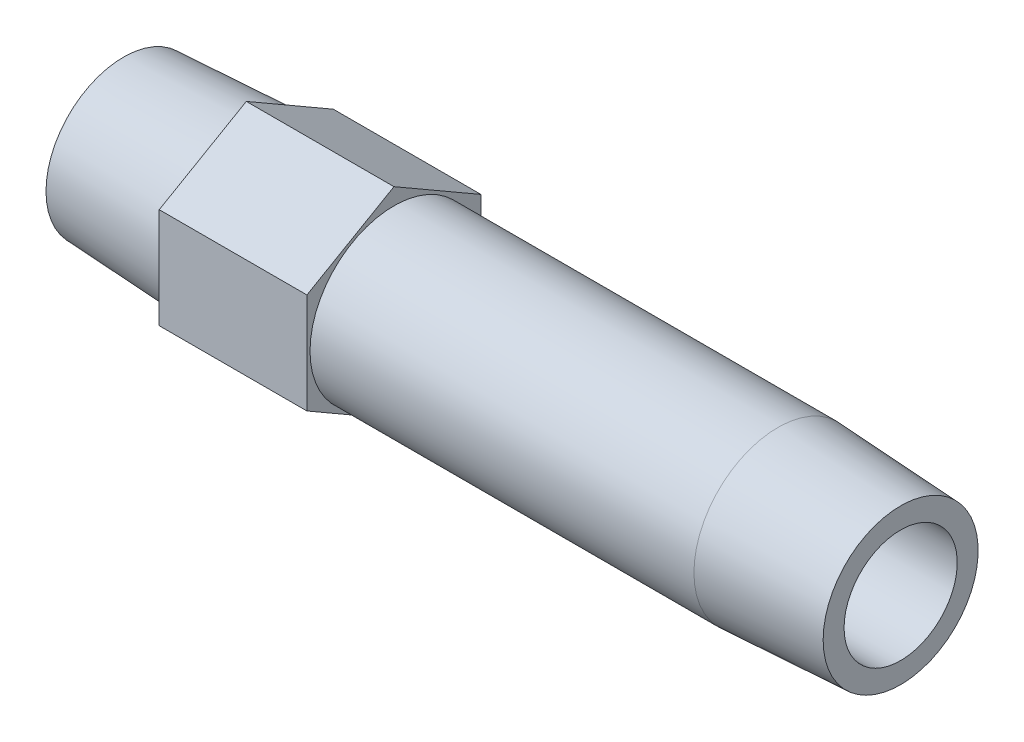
ISO-10303-21;
HEADER;
FILE_DESCRIPTION(('STEP AP214'),'2;1');
FILE_NAME('part.step','',(''),(''),'','','');
FILE_SCHEMA(('AUTOMOTIVE_DESIGN { 1 0 10303 214 1 1 1 1 }'));
ENDSEC;
DATA;
#1=APPLICATION_CONTEXT('core data for automotive mechanical design processes');
#2=APPLICATION_PROTOCOL_DEFINITION('international standard','automotive_design',2000,#1);
#3=PRODUCT_CONTEXT('',#1,'mechanical');
#4=PRODUCT('Part','Part','',(#3));
#5=PRODUCT_RELATED_PRODUCT_CATEGORY('part','',(#4));
#6=PRODUCT_DEFINITION_FORMATION('','',#4);
#7=PRODUCT_DEFINITION_CONTEXT('part definition',#1,'design');
#8=PRODUCT_DEFINITION('design','',#6,#7);
#9=PRODUCT_DEFINITION_SHAPE('','',#8);
#10=(LENGTH_UNIT() NAMED_UNIT(*) SI_UNIT(.MILLI.,.METRE.));
#11=(NAMED_UNIT(*) PLANE_ANGLE_UNIT() SI_UNIT($,.RADIAN.));
#12=(NAMED_UNIT(*) SI_UNIT($,.STERADIAN.) SOLID_ANGLE_UNIT());
#13=UNCERTAINTY_MEASURE_WITH_UNIT(LENGTH_MEASURE(1.E-05),#10,'distance_accuracy_value','');
#14=(GEOMETRIC_REPRESENTATION_CONTEXT(3) GLOBAL_UNCERTAINTY_ASSIGNED_CONTEXT((#13)) GLOBAL_UNIT_ASSIGNED_CONTEXT((#10,
#11,#12)) REPRESENTATION_CONTEXT('',''));
#15=CARTESIAN_POINT('',(0.,0.,0.));
#16=DIRECTION('',(0.,0.,1.));
#17=DIRECTION('',(1.,0.,0.));
#18=AXIS2_PLACEMENT_3D('',#15,#16,#17);
#19=CARTESIAN_POINT('',(0.,0.,-6.3321927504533));
#20=DIRECTION('',(1.,0.,0.));
#21=DIRECTION('',(0.,0.,-1.));
#22=AXIS2_PLACEMENT_3D('',#19,#20,#21);
#23=PLANE('',#22);
#24=CARTESIAN_POINT('',(0.,0.,0.));
#25=DIRECTION('',(-1.,0.,0.));
#26=DIRECTION('',(0.,0.,1.));
#27=AXIS2_PLACEMENT_3D('',#24,#25,#26);
#28=CIRCLE('',#27,6.3321927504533);
#29=CARTESIAN_POINT('',(0.,0.,6.3321927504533));
#30=VERTEX_POINT('',#29);
#31=EDGE_CURVE('E147',#30,#30,#28,.T.);
#32=ORIENTED_EDGE('',*,*,#31,.T.);
#33=EDGE_LOOP('',(#32));
#34=FACE_BOUND('',#33,.T.);
#35=CARTESIAN_POINT('',(0.,0.,0.));
#36=DIRECTION('',(1.,0.,0.));
#37=DIRECTION('',(0.,0.,1.));
#38=AXIS2_PLACEMENT_3D('',#35,#36,#37);
#39=CIRCLE('',#38,4.6228);
#40=CARTESIAN_POINT('',(0.,0.,4.6228));
#41=VERTEX_POINT('',#40);
#42=EDGE_CURVE('E159',#41,#41,#39,.T.);
#43=ORIENTED_EDGE('',*,*,#42,.T.);
#44=EDGE_LOOP('',(#43));
#45=FACE_BOUND('',#44,.T.);
#46=ADVANCED_FACE('F15',(#34,#45),#23,.F.);
#47=CARTESIAN_POINT('',(63.5,0.,-6.33219275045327));
#48=DIRECTION('',(-1.,0.,0.));
#49=DIRECTION('',(0.,0.,1.));
#50=AXIS2_PLACEMENT_3D('',#47,#48,#49);
#51=PLANE('',#50);
#52=CARTESIAN_POINT('',(63.5,0.,0.));
#53=DIRECTION('',(-1.,0.,0.));
#54=DIRECTION('',(0.,0.,1.));
#55=AXIS2_PLACEMENT_3D('',#52,#53,#54);
#56=CIRCLE('',#55,6.33219275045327);
#57=CARTESIAN_POINT('',(63.5,0.,6.33219275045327));
#58=VERTEX_POINT('',#57);
#59=EDGE_CURVE('E150',#58,#58,#56,.T.);
#60=ORIENTED_EDGE('',*,*,#59,.F.);
#61=EDGE_LOOP('',(#60));
#62=FACE_BOUND('',#61,.T.);
#63=CARTESIAN_POINT('',(63.5,0.,0.));
#64=DIRECTION('',(-1.,0.,0.));
#65=DIRECTION('',(0.,0.,1.));
#66=AXIS2_PLACEMENT_3D('',#63,#64,#65);
#67=CIRCLE('',#66,4.6228);
#68=CARTESIAN_POINT('',(63.5,0.,4.6228));
#69=VERTEX_POINT('',#68);
#70=EDGE_CURVE('E156',#69,#69,#67,.F.);
#71=ORIENTED_EDGE('',*,*,#70,.F.);
#72=EDGE_LOOP('',(#71));
#73=FACE_BOUND('',#72,.T.);
#74=ADVANCED_FACE('F178',(#62,#73),#51,.F.);
#75=CARTESIAN_POINT('',(22.098,-12.3183453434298,7.112));
#76=DIRECTION('',(-1.,0.,0.));
#77=DIRECTION('',(0.,-1.,0.));
#78=AXIS2_PLACEMENT_3D('',#75,#76,#77);
#79=PLANE('',#78);
#80=DIRECTION('',(0.,0.5,-0.866025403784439));
#81=VECTOR('',#80,1.);
#82=CARTESIAN_POINT('',(22.098,-8.21223022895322,0.));
#83=LINE('',#82,#81);
#84=CARTESIAN_POINT('',(22.098,-8.21223022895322,0.));
#85=VERTEX_POINT('',#84);
#86=CARTESIAN_POINT('',(22.098,-4.10611511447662,-7.112));
#87=VERTEX_POINT('',#86);
#88=EDGE_CURVE('E103',#85,#87,#83,.T.);
#89=ORIENTED_EDGE('',*,*,#88,.T.);
#90=DIRECTION('',(0.,1.,0.));
#91=VECTOR('',#90,1.);
#92=CARTESIAN_POINT('',(22.098,-4.10611511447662,-7.112));
#93=LINE('',#92,#91);
#94=CARTESIAN_POINT('',(22.098,4.10611511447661,-7.112));
#95=VERTEX_POINT('',#94);
#96=EDGE_CURVE('E83',#87,#95,#93,.T.);
#97=ORIENTED_EDGE('',*,*,#96,.T.);
#98=DIRECTION('',(0.,0.5,0.866025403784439));
#99=VECTOR('',#98,1.);
#100=CARTESIAN_POINT('',(22.098,4.10611511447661,-7.112));
#101=LINE('',#100,#99);
#102=CARTESIAN_POINT('',(22.098,8.21223022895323,0.));
#103=VERTEX_POINT('',#102);
#104=EDGE_CURVE('E102',#95,#103,#101,.T.);
#105=ORIENTED_EDGE('',*,*,#104,.T.);
#106=DIRECTION('',(0.,-0.5,0.866025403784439));
#107=VECTOR('',#106,1.);
#108=CARTESIAN_POINT('',(22.098,8.21223022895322,0.));
#109=LINE('',#108,#107);
#110=CARTESIAN_POINT('',(22.098,4.10611511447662,7.112));
#111=VERTEX_POINT('',#110);
#112=EDGE_CURVE('E105',#103,#111,#109,.T.);
#113=ORIENTED_EDGE('',*,*,#112,.T.);
#114=DIRECTION('',(0.,-1.,0.));
#115=VECTOR('',#114,1.);
#116=CARTESIAN_POINT('',(22.098,4.10611511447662,7.112));
#117=LINE('',#116,#115);
#118=CARTESIAN_POINT('',(22.098,-4.10611511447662,7.112));
#119=VERTEX_POINT('',#118);
#120=EDGE_CURVE('E35',#111,#119,#117,.T.);
#121=ORIENTED_EDGE('',*,*,#120,.T.);
#122=DIRECTION('',(0.,-0.5,-0.866025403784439));
#123=VECTOR('',#122,1.);
#124=CARTESIAN_POINT('',(22.098,-4.10611511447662,7.112));
#125=LINE('',#124,#123);
#126=EDGE_CURVE('E30',#119,#85,#125,.T.);
#127=ORIENTED_EDGE('',*,*,#126,.T.);
#128=EDGE_LOOP('',(#89,#97,#105,#113,#121,#127));
#129=FACE_BOUND('',#128,.T.);
#130=CARTESIAN_POINT('',(22.098,0.,0.));
#131=DIRECTION('',(-1.,0.,0.));
#132=DIRECTION('',(0.,-1.,0.));
#133=AXIS2_PLACEMENT_3D('',#130,#131,#132);
#134=CIRCLE('',#133,6.858);
#135=CARTESIAN_POINT('',(22.098,-6.858,0.));
#136=VERTEX_POINT('',#135);
#137=EDGE_CURVE('E89',#136,#136,#134,.F.);
#138=ORIENTED_EDGE('',*,*,#137,.F.);
#139=EDGE_LOOP('',(#138));
#140=FACE_BOUND('',#139,.T.);
#141=ADVANCED_FACE('F124',(#129,#140),#79,.F.);
#142=CARTESIAN_POINT('',(10.033,-12.3183453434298,7.112));
#143=DIRECTION('',(-1.,0.,0.));
#144=DIRECTION('',(0.,-1.,0.));
#145=AXIS2_PLACEMENT_3D('',#142,#143,#144);
#146=PLANE('',#145);
#147=DIRECTION('',(0.,0.5,-0.866025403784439));
#148=VECTOR('',#147,1.);
#149=CARTESIAN_POINT('',(10.033,-8.21223022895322,0.));
#150=LINE('',#149,#148);
#151=CARTESIAN_POINT('',(10.033,-8.21223022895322,0.));
#152=VERTEX_POINT('',#151);
#153=CARTESIAN_POINT('',(10.033,-4.10611511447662,-7.112));
#154=VERTEX_POINT('',#153);
#155=EDGE_CURVE('E73',#152,#154,#150,.T.);
#156=ORIENTED_EDGE('',*,*,#155,.F.);
#157=DIRECTION('',(0.,-0.5,-0.866025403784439));
#158=VECTOR('',#157,1.);
#159=CARTESIAN_POINT('',(10.033,-4.10611511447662,7.112));
#160=LINE('',#159,#158);
#161=CARTESIAN_POINT('',(10.033,-4.10611511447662,7.112));
#162=VERTEX_POINT('',#161);
#163=EDGE_CURVE('E99',#162,#152,#160,.T.);
#164=ORIENTED_EDGE('',*,*,#163,.F.);
#165=DIRECTION('',(0.,-1.,0.));
#166=VECTOR('',#165,1.);
#167=CARTESIAN_POINT('',(10.033,4.10611511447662,7.112));
#168=LINE('',#167,#166);
#169=CARTESIAN_POINT('',(10.033,4.10611511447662,7.112));
#170=VERTEX_POINT('',#169);
#171=EDGE_CURVE('E133',#170,#162,#168,.T.);
#172=ORIENTED_EDGE('',*,*,#171,.F.);
#173=DIRECTION('',(0.,-0.5,0.866025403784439));
#174=VECTOR('',#173,1.);
#175=CARTESIAN_POINT('',(10.033,8.21223022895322,0.));
#176=LINE('',#175,#174);
#177=CARTESIAN_POINT('',(10.033,8.21223022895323,0.));
#178=VERTEX_POINT('',#177);
#179=EDGE_CURVE('E129',#178,#170,#176,.T.);
#180=ORIENTED_EDGE('',*,*,#179,.F.);
#181=DIRECTION('',(0.,0.5,0.866025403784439));
#182=VECTOR('',#181,1.);
#183=CARTESIAN_POINT('',(10.033,4.10611511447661,-7.112));
#184=LINE('',#183,#182);
#185=CARTESIAN_POINT('',(10.033,4.10611511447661,-7.112));
#186=VERTEX_POINT('',#185);
#187=EDGE_CURVE('E75',#186,#178,#184,.T.);
#188=ORIENTED_EDGE('',*,*,#187,.F.);
#189=DIRECTION('',(0.,1.,0.));
#190=VECTOR('',#189,1.);
#191=CARTESIAN_POINT('',(10.033,-4.10611511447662,-7.112));
#192=LINE('',#191,#190);
#193=EDGE_CURVE('E68',#154,#186,#192,.T.);
#194=ORIENTED_EDGE('',*,*,#193,.F.);
#195=EDGE_LOOP('',(#156,#164,#172,#180,#188,#194));
#196=FACE_BOUND('',#195,.T.);
#197=CARTESIAN_POINT('',(10.033,0.,0.));
#198=DIRECTION('',(-1.,0.,0.));
#199=DIRECTION('',(0.,0.,1.));
#200=AXIS2_PLACEMENT_3D('',#197,#198,#199);
#201=CIRCLE('',#200,6.858);
#202=CARTESIAN_POINT('',(10.033,0.,6.858));
#203=VERTEX_POINT('',#202);
#204=EDGE_CURVE('E95',#203,#203,#201,.T.);
#205=ORIENTED_EDGE('',*,*,#204,.F.);
#206=EDGE_LOOP('',(#205));
#207=FACE_BOUND('',#206,.T.);
#208=ADVANCED_FACE('F69',(#196,#207),#146,.T.);
#209=CARTESIAN_POINT('',(22.098,-8.21223022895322,0.));
#210=DIRECTION('',(0.,0.866025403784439,0.5));
#211=DIRECTION('',(0.,-0.5,0.866025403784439));
#212=AXIS2_PLACEMENT_3D('',#209,#210,#211);
#213=PLANE('',#212);
#214=ORIENTED_EDGE('',*,*,#155,.T.);
#215=DIRECTION('',(-1.,0.,0.));
#216=VECTOR('',#215,1.);
#217=CARTESIAN_POINT('',(22.098,-4.10611511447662,-7.112));
#218=LINE('',#217,#216);
#219=EDGE_CURVE('E10',#87,#154,#218,.T.);
#220=ORIENTED_EDGE('',*,*,#219,.F.);
#221=ORIENTED_EDGE('',*,*,#88,.F.);
#222=DIRECTION('',(-1.,0.,0.));
#223=VECTOR('',#222,1.);
#224=CARTESIAN_POINT('',(22.098,-8.21223022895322,0.));
#225=LINE('',#224,#223);
#226=EDGE_CURVE('E87',#85,#152,#225,.T.);
#227=ORIENTED_EDGE('',*,*,#226,.T.);
#228=EDGE_LOOP('',(#214,#220,#221,#227));
#229=FACE_BOUND('',#228,.T.);
#230=ADVANCED_FACE('F17',(#229),#213,.F.);
#231=CARTESIAN_POINT('',(22.098,-4.10611511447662,-7.112));
#232=DIRECTION('',(0.,0.,1.));
#233=DIRECTION('',(0.,-1.,0.));
#234=AXIS2_PLACEMENT_3D('',#231,#232,#233);
#235=PLANE('',#234);
#236=ORIENTED_EDGE('',*,*,#193,.T.);
#237=DIRECTION('',(-1.,0.,0.));
#238=VECTOR('',#237,1.);
#239=CARTESIAN_POINT('',(22.098,4.10611511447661,-7.112));
#240=LINE('',#239,#238);
#241=EDGE_CURVE('E23',#95,#186,#240,.T.);
#242=ORIENTED_EDGE('',*,*,#241,.F.);
#243=ORIENTED_EDGE('',*,*,#96,.F.);
#244=ORIENTED_EDGE('',*,*,#219,.T.);
#245=EDGE_LOOP('',(#236,#242,#243,#244));
#246=FACE_BOUND('',#245,.T.);
#247=ADVANCED_FACE('F82',(#246),#235,.F.);
#248=CARTESIAN_POINT('',(22.098,4.10611511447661,-7.112));
#249=DIRECTION('',(0.,-0.866025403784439,0.5));
#250=DIRECTION('',(0.,-0.5,-0.866025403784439));
#251=AXIS2_PLACEMENT_3D('',#248,#249,#250);
#252=PLANE('',#251);
#253=ORIENTED_EDGE('',*,*,#187,.T.);
#254=DIRECTION('',(-1.,0.,0.));
#255=VECTOR('',#254,1.);
#256=CARTESIAN_POINT('',(22.098,8.21223022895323,0.));
#257=LINE('',#256,#255);
#258=EDGE_CURVE('E117',#103,#178,#257,.T.);
#259=ORIENTED_EDGE('',*,*,#258,.F.);
#260=ORIENTED_EDGE('',*,*,#104,.F.);
#261=ORIENTED_EDGE('',*,*,#241,.T.);
#262=EDGE_LOOP('',(#253,#259,#260,#261));
#263=FACE_BOUND('',#262,.T.);
#264=ADVANCED_FACE('F121',(#263),#252,.F.);
#265=CARTESIAN_POINT('',(22.098,8.21223022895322,0.));
#266=DIRECTION('',(0.,-0.866025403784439,-0.5));
#267=DIRECTION('',(0.,0.5,-0.866025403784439));
#268=AXIS2_PLACEMENT_3D('',#265,#266,#267);
#269=PLANE('',#268);
#270=ORIENTED_EDGE('',*,*,#179,.T.);
#271=DIRECTION('',(-1.,0.,0.));
#272=VECTOR('',#271,1.);
#273=CARTESIAN_POINT('',(22.098,4.10611511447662,7.112));
#274=LINE('',#273,#272);
#275=EDGE_CURVE('E114',#111,#170,#274,.T.);
#276=ORIENTED_EDGE('',*,*,#275,.F.);
#277=ORIENTED_EDGE('',*,*,#112,.F.);
#278=ORIENTED_EDGE('',*,*,#258,.T.);
#279=EDGE_LOOP('',(#270,#276,#277,#278));
#280=FACE_BOUND('',#279,.T.);
#281=ADVANCED_FACE('F128',(#280),#269,.F.);
#282=CARTESIAN_POINT('',(22.098,4.10611511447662,7.112));
#283=DIRECTION('',(0.,0.,-1.));
#284=DIRECTION('',(-1.,0.,0.));
#285=AXIS2_PLACEMENT_3D('',#282,#283,#284);
#286=PLANE('',#285);
#287=ORIENTED_EDGE('',*,*,#171,.T.);
#288=DIRECTION('',(-1.,0.,0.));
#289=VECTOR('',#288,1.);
#290=CARTESIAN_POINT('',(22.098,-4.10611511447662,7.112));
#291=LINE('',#290,#289);
#292=EDGE_CURVE('E111',#119,#162,#291,.T.);
#293=ORIENTED_EDGE('',*,*,#292,.F.);
#294=ORIENTED_EDGE('',*,*,#120,.F.);
#295=ORIENTED_EDGE('',*,*,#275,.T.);
#296=EDGE_LOOP('',(#287,#293,#294,#295));
#297=FACE_BOUND('',#296,.T.);
#298=ADVANCED_FACE('F132',(#297),#286,.F.);
#299=CARTESIAN_POINT('',(22.098,-4.10611511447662,7.112));
#300=DIRECTION('',(0.,0.866025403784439,-0.5));
#301=DIRECTION('',(0.,0.5,0.866025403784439));
#302=AXIS2_PLACEMENT_3D('',#299,#300,#301);
#303=PLANE('',#302);
#304=ORIENTED_EDGE('',*,*,#163,.T.);
#305=ORIENTED_EDGE('',*,*,#226,.F.);
#306=ORIENTED_EDGE('',*,*,#126,.F.);
#307=ORIENTED_EDGE('',*,*,#292,.T.);
#308=EDGE_LOOP('',(#304,#305,#306,#307));
#309=FACE_BOUND('',#308,.T.);
#310=ADVANCED_FACE('F135',(#309),#303,.F.);
#311=CARTESIAN_POINT('',(10.033,0.,0.));
#312=DIRECTION('',(1.,0.,0.));
#313=DIRECTION('',(0.,0.,-1.));
#314=AXIS2_PLACEMENT_3D('',#311,#312,#313);
#315=CONICAL_SURFACE('',#314,6.858,0.0523598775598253);
#316=ORIENTED_EDGE('',*,*,#31,.F.);
#317=EDGE_LOOP('',(#316));
#318=FACE_BOUND('',#317,.T.);
#319=ORIENTED_EDGE('',*,*,#204,.T.);
#320=EDGE_LOOP('',(#319));
#321=FACE_BOUND('',#320,.T.);
#322=ADVANCED_FACE('F187',(#318,#321),#315,.T.);
#323=CARTESIAN_POINT('',(-60.,0.,0.));
#324=DIRECTION('',(-1.,0.,0.));
#325=DIRECTION('',(0.,0.,1.));
#326=AXIS2_PLACEMENT_3D('',#323,#324,#325);
#327=CYLINDRICAL_SURFACE('',#326,6.858);
#328=ORIENTED_EDGE('',*,*,#137,.T.);
#329=EDGE_LOOP('',(#328));
#330=FACE_BOUND('',#329,.T.);
#331=CARTESIAN_POINT('',(53.467,0.,0.));
#332=DIRECTION('',(-1.,0.,0.));
#333=DIRECTION('',(0.,0.,1.));
#334=AXIS2_PLACEMENT_3D('',#331,#332,#333);
#335=CIRCLE('',#334,6.858);
#336=CARTESIAN_POINT('',(53.467,0.,6.858));
#337=VERTEX_POINT('',#336);
#338=EDGE_CURVE('E153',#337,#337,#335,.T.);
#339=ORIENTED_EDGE('',*,*,#338,.T.);
#340=EDGE_LOOP('',(#339));
#341=FACE_BOUND('',#340,.T.);
#342=ADVANCED_FACE('F174',(#330,#341),#327,.T.);
#343=CARTESIAN_POINT('',(63.5,0.,0.));
#344=DIRECTION('',(-1.,0.,0.));
#345=DIRECTION('',(0.,0.,1.));
#346=AXIS2_PLACEMENT_3D('',#343,#344,#345);
#347=CONICAL_SURFACE('',#346,6.33219275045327,0.0523598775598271);
#348=ORIENTED_EDGE('',*,*,#338,.F.);
#349=EDGE_LOOP('',(#348));
#350=FACE_BOUND('',#349,.T.);
#351=ORIENTED_EDGE('',*,*,#59,.T.);
#352=EDGE_LOOP('',(#351));
#353=FACE_BOUND('',#352,.T.);
#354=ADVANCED_FACE('F167',(#350,#353),#347,.T.);
#355=CARTESIAN_POINT('',(67.1143433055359,0.,0.));
#356=DIRECTION('',(-1.,0.,0.));
#357=DIRECTION('',(0.,0.,1.));
#358=AXIS2_PLACEMENT_3D('',#355,#356,#357);
#359=CYLINDRICAL_SURFACE('',#358,4.6228);
#360=ORIENTED_EDGE('',*,*,#70,.T.);
#361=EDGE_LOOP('',(#360));
#362=FACE_BOUND('',#361,.T.);
#363=ORIENTED_EDGE('',*,*,#42,.F.);
#364=EDGE_LOOP('',(#363));
#365=FACE_BOUND('',#364,.T.);
#366=ADVANCED_FACE('F165',(#362,#365),#359,.F.);
#367=CLOSED_SHELL('',(#46,#74,#141,#208,#230,#247,#264,#281,#298,#310,#322,#342,#354,#366));
#368=MANIFOLD_SOLID_BREP('B1',#367);
#369=ADVANCED_BREP_SHAPE_REPRESENTATION('',(#18,#368),#14);
#370=SHAPE_DEFINITION_REPRESENTATION(#9,#369);
ENDSEC;
END-ISO-10303-21;
